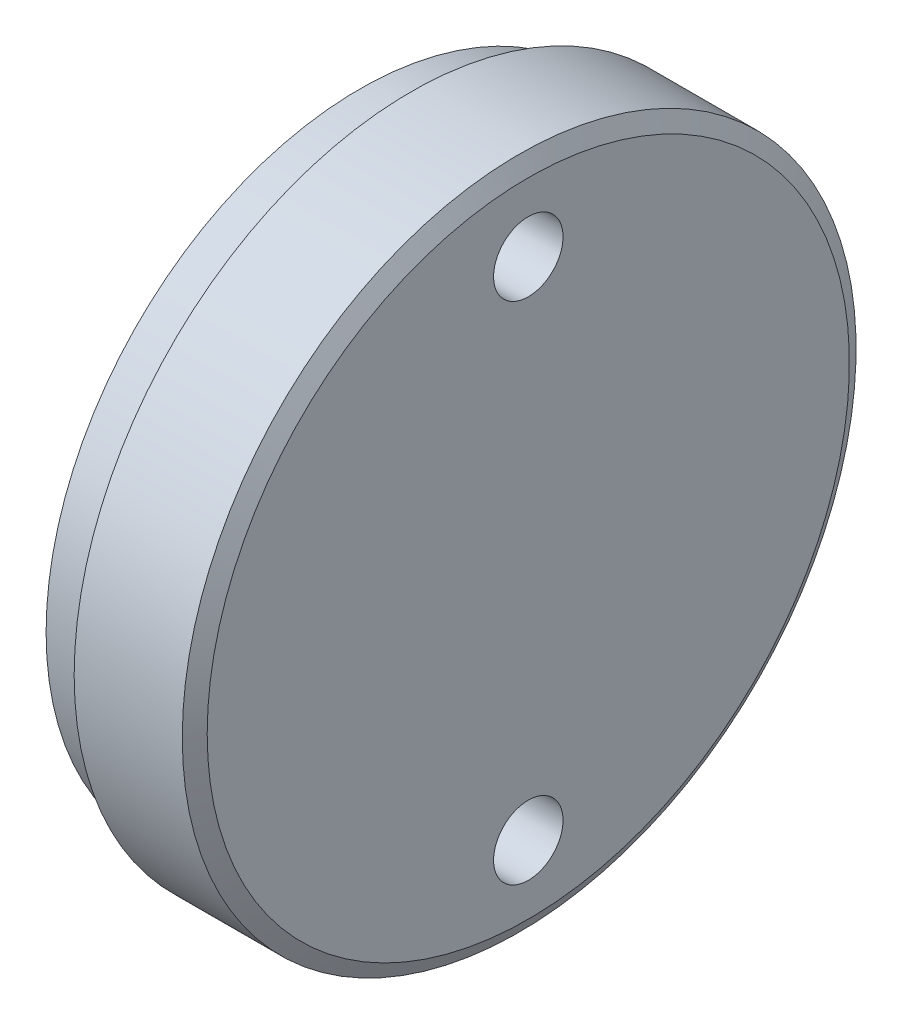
ISO-10303-21;
HEADER;
FILE_DESCRIPTION(('STEP AP214'),'2;1');
FILE_NAME('part.step','',(''),(''),'','','');
FILE_SCHEMA(('AUTOMOTIVE_DESIGN { 1 0 10303 214 1 1 1 1 }'));
ENDSEC;
DATA;
#1=APPLICATION_CONTEXT('core data for automotive mechanical design processes');
#2=APPLICATION_PROTOCOL_DEFINITION('international standard','automotive_design',2000,#1);
#3=PRODUCT_CONTEXT('',#1,'mechanical');
#4=PRODUCT('Part','Part','',(#3));
#5=PRODUCT_RELATED_PRODUCT_CATEGORY('part','',(#4));
#6=PRODUCT_DEFINITION_FORMATION('','',#4);
#7=PRODUCT_DEFINITION_CONTEXT('part definition',#1,'design');
#8=PRODUCT_DEFINITION('design','',#6,#7);
#9=PRODUCT_DEFINITION_SHAPE('','',#8);
#10=(LENGTH_UNIT() NAMED_UNIT(*) SI_UNIT(.MILLI.,.METRE.));
#11=(NAMED_UNIT(*) PLANE_ANGLE_UNIT() SI_UNIT($,.RADIAN.));
#12=(NAMED_UNIT(*) SI_UNIT($,.STERADIAN.) SOLID_ANGLE_UNIT());
#13=UNCERTAINTY_MEASURE_WITH_UNIT(LENGTH_MEASURE(1.E-05),#10,'distance_accuracy_value','');
#14=(GEOMETRIC_REPRESENTATION_CONTEXT(3) GLOBAL_UNCERTAINTY_ASSIGNED_CONTEXT((#13)) GLOBAL_UNIT_ASSIGNED_CONTEXT((#10,
#11,#12)) REPRESENTATION_CONTEXT('',''));
#15=CARTESIAN_POINT('',(0.,0.,0.));
#16=DIRECTION('',(0.,0.,1.));
#17=DIRECTION('',(1.,0.,0.));
#18=AXIS2_PLACEMENT_3D('',#15,#16,#17);
#19=CARTESIAN_POINT('',(46.5,32.954952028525,-32.));
#20=DIRECTION('',(-1.,0.,0.));
#21=DIRECTION('',(0.,0.,1.));
#22=AXIS2_PLACEMENT_3D('',#19,#20,#21);
#23=PLANE('',#22);
#24=CARTESIAN_POINT('',(46.5,25.07,-32.));
#25=DIRECTION('',(1.,0.,0.));
#26=DIRECTION('',(0.,0.,1.));
#27=AXIS2_PLACEMENT_3D('',#24,#25,#26);
#28=CIRCLE('',#27,6.48602905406);
#29=CARTESIAN_POINT('',(46.5,25.07,-25.51397094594));
#30=VERTEX_POINT('',#29);
#31=EDGE_CURVE('E63',#30,#30,#28,.F.);
#32=ORIENTED_EDGE('',*,*,#31,.T.);
#33=EDGE_LOOP('',(#32));
#34=FACE_BOUND('',#33,.T.);
#35=ADVANCED_FACE('F17',(#34),#23,.T.);
#36=CARTESIAN_POINT('',(43.5,25.07,-32.));
#37=DIRECTION('',(-1.,0.,0.));
#38=DIRECTION('',(0.,0.,1.));
#39=AXIS2_PLACEMENT_3D('',#36,#37,#38);
#40=TOROIDAL_SURFACE('',#39,6.48602905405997,3.);
#41=CARTESIAN_POINT('',(45.4283628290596,25.07,-32.));
#42=DIRECTION('',(-1.,0.,0.));
#43=DIRECTION('',(0.,0.,1.));
#44=AXIS2_PLACEMENT_3D('',#41,#42,#43);
#45=CIRCLE('',#44,8.7841623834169);
#46=CARTESIAN_POINT('',(45.4283628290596,25.07,-23.2158376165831));
#47=VERTEX_POINT('',#46);
#48=EDGE_CURVE('E89',#47,#47,#45,.T.);
#49=ORIENTED_EDGE('',*,*,#48,.T.);
#50=EDGE_LOOP('',(#49));
#51=FACE_BOUND('',#50,.T.);
#52=ORIENTED_EDGE('',*,*,#31,.F.);
#53=EDGE_LOOP('',(#52));
#54=FACE_BOUND('',#53,.T.);
#55=ADVANCED_FACE('F68',(#51,#54),#40,.F.);
#56=CARTESIAN_POINT('',(41.,25.07,-32.));
#57=DIRECTION('',(-1.,0.,0.));
#58=DIRECTION('',(0.,0.,1.));
#59=AXIS2_PLACEMENT_3D('',#56,#57,#58);
#60=CONICAL_SURFACE('',#59,12.5,0.698131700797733);
#61=CARTESIAN_POINT('',(41.,25.07,-32.));
#62=DIRECTION('',(-1.,0.,0.));
#63=DIRECTION('',(0.,0.,1.));
#64=AXIS2_PLACEMENT_3D('',#61,#62,#63);
#65=CIRCLE('',#64,12.5);
#66=CARTESIAN_POINT('',(41.,25.07,-19.5));
#67=VERTEX_POINT('',#66);
#68=EDGE_CURVE('E21',#67,#67,#65,.F.);
#69=ORIENTED_EDGE('',*,*,#68,.F.);
#70=EDGE_LOOP('',(#69));
#71=FACE_BOUND('',#70,.T.);
#72=ORIENTED_EDGE('',*,*,#48,.F.);
#73=EDGE_LOOP('',(#72));
#74=FACE_BOUND('',#73,.T.);
#75=ADVANCED_FACE('F79',(#71,#74),#60,.F.);
#76=CARTESIAN_POINT('',(41.,39.97,-32.));
#77=DIRECTION('',(-1.,0.,0.));
#78=DIRECTION('',(0.,0.,1.));
#79=AXIS2_PLACEMENT_3D('',#76,#77,#78);
#80=PLANE('',#79);
#81=CARTESIAN_POINT('',(41.,25.07,-32.));
#82=DIRECTION('',(-1.,0.,0.));
#83=DIRECTION('',(0.,0.,1.));
#84=AXIS2_PLACEMENT_3D('',#81,#82,#83);
#85=CIRCLE('',#84,14.9);
#86=CARTESIAN_POINT('',(41.,25.07,-17.1));
#87=VERTEX_POINT('',#86);
#88=EDGE_CURVE('E106',#87,#87,#85,.F.);
#89=ORIENTED_EDGE('',*,*,#88,.F.);
#90=EDGE_LOOP('',(#89));
#91=FACE_BOUND('',#90,.T.);
#92=ORIENTED_EDGE('',*,*,#68,.T.);
#93=EDGE_LOOP('',(#92));
#94=FACE_BOUND('',#93,.T.);
#95=ADVANCED_FACE('F115',(#91,#94),#80,.T.);
#96=CARTESIAN_POINT('',(49.,25.07,-32.));
#97=DIRECTION('',(-1.,0.,0.));
#98=DIRECTION('',(0.,0.,1.));
#99=AXIS2_PLACEMENT_3D('',#96,#97,#98);
#100=CYLINDRICAL_SURFACE('',#99,14.9);
#101=CARTESIAN_POINT('',(43.,25.07,-32.));
#102=DIRECTION('',(-1.,0.,0.));
#103=DIRECTION('',(0.,0.,1.));
#104=AXIS2_PLACEMENT_3D('',#101,#102,#103);
#105=CIRCLE('',#104,14.9);
#106=CARTESIAN_POINT('',(43.,25.07,-17.1));
#107=VERTEX_POINT('',#106);
#108=EDGE_CURVE('E101',#107,#107,#105,.F.);
#109=ORIENTED_EDGE('',*,*,#108,.F.);
#110=EDGE_LOOP('',(#109));
#111=FACE_BOUND('',#110,.T.);
#112=ORIENTED_EDGE('',*,*,#88,.T.);
#113=EDGE_LOOP('',(#112));
#114=FACE_BOUND('',#113,.T.);
#115=ADVANCED_FACE('F124',(#111,#114),#100,.T.);
#116=CARTESIAN_POINT('',(43.,41.07,-32.));
#117=DIRECTION('',(-1.,0.,0.));
#118=DIRECTION('',(0.,0.,1.));
#119=AXIS2_PLACEMENT_3D('',#116,#117,#118);
#120=PLANE('',#119);
#121=ORIENTED_EDGE('',*,*,#108,.T.);
#122=EDGE_LOOP('',(#121));
#123=FACE_BOUND('',#122,.T.);
#124=CARTESIAN_POINT('',(43.,25.07,-32.));
#125=DIRECTION('',(1.,0.,0.));
#126=DIRECTION('',(0.,0.,-1.));
#127=AXIS2_PLACEMENT_3D('',#124,#125,#126);
#128=CIRCLE('',#127,15.25);
#129=CARTESIAN_POINT('',(43.,25.07,-47.25));
#130=VERTEX_POINT('',#129);
#131=EDGE_CURVE('E96',#130,#130,#128,.T.);
#132=ORIENTED_EDGE('',*,*,#131,.F.);
#133=EDGE_LOOP('',(#132));
#134=FACE_BOUND('',#133,.T.);
#135=ADVANCED_FACE('F154',(#123,#134),#120,.T.);
#136=CARTESIAN_POINT('',(43.4330127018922,25.07,-32.));
#137=DIRECTION('',(1.,0.,0.));
#138=DIRECTION('',(0.,0.,-1.));
#139=AXIS2_PLACEMENT_3D('',#136,#137,#138);
#140=CONICAL_SURFACE('',#139,16.,1.0471975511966);
#141=CARTESIAN_POINT('',(43.4330127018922,25.07,-32.));
#142=DIRECTION('',(-1.,0.,0.));
#143=DIRECTION('',(0.,0.,1.));
#144=AXIS2_PLACEMENT_3D('',#141,#142,#143);
#145=CIRCLE('',#144,16.);
#146=CARTESIAN_POINT('',(43.4330127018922,25.07,-16.));
#147=VERTEX_POINT('',#146);
#148=EDGE_CURVE('E50',#147,#147,#145,.F.);
#149=ORIENTED_EDGE('',*,*,#148,.F.);
#150=EDGE_LOOP('',(#149));
#151=FACE_BOUND('',#150,.T.);
#152=ORIENTED_EDGE('',*,*,#131,.T.);
#153=EDGE_LOOP('',(#152));
#154=FACE_BOUND('',#153,.T.);
#155=ADVANCED_FACE('F149',(#151,#154),#140,.T.);
#156=CARTESIAN_POINT('',(49.,25.07,-32.));
#157=DIRECTION('',(-1.,0.,0.));
#158=DIRECTION('',(0.,0.,1.));
#159=AXIS2_PLACEMENT_3D('',#156,#157,#158);
#160=CYLINDRICAL_SURFACE('',#159,16.);
#161=ORIENTED_EDGE('',*,*,#148,.T.);
#162=EDGE_LOOP('',(#161));
#163=FACE_BOUND('',#162,.T.);
#164=CARTESIAN_POINT('',(48.5669872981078,25.07,-32.));
#165=DIRECTION('',(-1.,0.,0.));
#166=DIRECTION('',(0.,0.,1.));
#167=AXIS2_PLACEMENT_3D('',#164,#165,#166);
#168=CIRCLE('',#167,16.);
#169=CARTESIAN_POINT('',(48.5669872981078,25.07,-16.));
#170=VERTEX_POINT('',#169);
#171=EDGE_CURVE('E44',#170,#170,#168,.F.);
#172=ORIENTED_EDGE('',*,*,#171,.F.);
#173=EDGE_LOOP('',(#172));
#174=FACE_BOUND('',#173,.T.);
#175=ADVANCED_FACE('F37',(#163,#174),#160,.T.);
#176=CARTESIAN_POINT('',(45.0000000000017,13.07,-32.));
#177=DIRECTION('',(1.,0.,0.));
#178=DIRECTION('',(0.,1.,0.));
#179=AXIS2_PLACEMENT_3D('',#176,#177,#178);
#180=CONICAL_SURFACE('',#179,1.64999999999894,1.04719755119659);
#181=CARTESIAN_POINT('',(44.0473720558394,13.07,-32.));
#182=VERTEX_POINT('',#181);
#183=VERTEX_LOOP('',#182);
#184=FACE_BOUND('',#183,.T.);
#185=CARTESIAN_POINT('',(45.,13.07,-32.));
#186=DIRECTION('',(-1.,0.,0.));
#187=DIRECTION('',(0.,0.,1.));
#188=AXIS2_PLACEMENT_3D('',#185,#186,#187);
#189=CIRCLE('',#188,1.65);
#190=CARTESIAN_POINT('',(45.,13.07,-30.35));
#191=VERTEX_POINT('',#190);
#192=EDGE_CURVE('E41',#191,#191,#189,.F.);
#193=ORIENTED_EDGE('',*,*,#192,.T.);
#194=EDGE_LOOP('',(#193));
#195=FACE_BOUND('',#194,.T.);
#196=ADVANCED_FACE('F33',(#184,#195),#180,.F.);
#197=CARTESIAN_POINT('',(45.0000000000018,37.07,-32.));
#198=DIRECTION('',(1.,0.,0.));
#199=DIRECTION('',(0.,1.,0.));
#200=AXIS2_PLACEMENT_3D('',#197,#198,#199);
#201=CONICAL_SURFACE('',#200,1.649999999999,1.04719755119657);
#202=CARTESIAN_POINT('',(44.0473720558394,37.0699999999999,-32.));
#203=VERTEX_POINT('',#202);
#204=VERTEX_LOOP('',#203);
#205=FACE_BOUND('',#204,.T.);
#206=CARTESIAN_POINT('',(45.,37.07,-32.));
#207=DIRECTION('',(-1.,0.,0.));
#208=DIRECTION('',(0.,0.,1.));
#209=AXIS2_PLACEMENT_3D('',#206,#207,#208);
#210=CIRCLE('',#209,1.65);
#211=CARTESIAN_POINT('',(45.,37.07,-30.35));
#212=VERTEX_POINT('',#211);
#213=EDGE_CURVE('E43',#212,#212,#210,.F.);
#214=ORIENTED_EDGE('',*,*,#213,.T.);
#215=EDGE_LOOP('',(#214));
#216=FACE_BOUND('',#215,.T.);
#217=ADVANCED_FACE('F36',(#205,#216),#201,.F.);
#218=CARTESIAN_POINT('',(48.5669872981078,25.07,-32.));
#219=DIRECTION('',(-1.,0.,0.));
#220=DIRECTION('',(0.,0.,1.));
#221=AXIS2_PLACEMENT_3D('',#218,#219,#220);
#222=CONICAL_SURFACE('',#221,16.,1.0471975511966);
#223=CARTESIAN_POINT('',(49.,25.07,-32.));
#224=DIRECTION('',(-1.,0.,0.));
#225=DIRECTION('',(0.,0.,1.));
#226=AXIS2_PLACEMENT_3D('',#223,#224,#225);
#227=CIRCLE('',#226,15.25);
#228=CARTESIAN_POINT('',(49.,25.07,-16.75));
#229=VERTEX_POINT('',#228);
#230=EDGE_CURVE('E47',#229,#229,#227,.F.);
#231=ORIENTED_EDGE('',*,*,#230,.F.);
#232=EDGE_LOOP('',(#231));
#233=FACE_BOUND('',#232,.T.);
#234=ORIENTED_EDGE('',*,*,#171,.T.);
#235=EDGE_LOOP('',(#234));
#236=FACE_BOUND('',#235,.T.);
#237=ADVANCED_FACE('F142',(#233,#236),#222,.T.);
#238=CARTESIAN_POINT('',(45.,13.07,-32.));
#239=DIRECTION('',(-1.,0.,0.));
#240=DIRECTION('',(0.,0.,1.));
#241=AXIS2_PLACEMENT_3D('',#238,#239,#240);
#242=CYLINDRICAL_SURFACE('',#241,1.65);
#243=ORIENTED_EDGE('',*,*,#192,.F.);
#244=EDGE_LOOP('',(#243));
#245=FACE_BOUND('',#244,.T.);
#246=CARTESIAN_POINT('',(49.,13.07,-32.));
#247=DIRECTION('',(-1.,0.,0.));
#248=DIRECTION('',(0.,0.,1.));
#249=AXIS2_PLACEMENT_3D('',#246,#247,#248);
#250=CIRCLE('',#249,1.65);
#251=CARTESIAN_POINT('',(49.,13.07,-30.35));
#252=VERTEX_POINT('',#251);
#253=EDGE_CURVE('E26',#252,#252,#250,.T.);
#254=ORIENTED_EDGE('',*,*,#253,.F.);
#255=EDGE_LOOP('',(#254));
#256=FACE_BOUND('',#255,.T.);
#257=ADVANCED_FACE('F132',(#245,#256),#242,.F.);
#258=CARTESIAN_POINT('',(45.,37.07,-32.));
#259=DIRECTION('',(-1.,0.,0.));
#260=DIRECTION('',(0.,0.,1.));
#261=AXIS2_PLACEMENT_3D('',#258,#259,#260);
#262=CYLINDRICAL_SURFACE('',#261,1.65);
#263=ORIENTED_EDGE('',*,*,#213,.F.);
#264=EDGE_LOOP('',(#263));
#265=FACE_BOUND('',#264,.T.);
#266=CARTESIAN_POINT('',(49.,37.07,-32.));
#267=DIRECTION('',(-1.,0.,0.));
#268=DIRECTION('',(0.,0.,1.));
#269=AXIS2_PLACEMENT_3D('',#266,#267,#268);
#270=CIRCLE('',#269,1.65);
#271=CARTESIAN_POINT('',(49.,37.07,-30.35));
#272=VERTEX_POINT('',#271);
#273=EDGE_CURVE('E11',#272,#272,#270,.T.);
#274=ORIENTED_EDGE('',*,*,#273,.F.);
#275=EDGE_LOOP('',(#274));
#276=FACE_BOUND('',#275,.T.);
#277=ADVANCED_FACE('F127',(#265,#276),#262,.F.);
#278=CARTESIAN_POINT('',(49.,25.07,-32.));
#279=DIRECTION('',(1.,0.,0.));
#280=DIRECTION('',(0.,0.,-1.));
#281=AXIS2_PLACEMENT_3D('',#278,#279,#280);
#282=PLANE('',#281);
#283=ORIENTED_EDGE('',*,*,#273,.T.);
#284=EDGE_LOOP('',(#283));
#285=FACE_BOUND('',#284,.T.);
#286=ORIENTED_EDGE('',*,*,#253,.T.);
#287=EDGE_LOOP('',(#286));
#288=FACE_BOUND('',#287,.T.);
#289=ORIENTED_EDGE('',*,*,#230,.T.);
#290=EDGE_LOOP('',(#289));
#291=FACE_BOUND('',#290,.T.);
#292=ADVANCED_FACE('F19',(#285,#288,#291),#282,.T.);
#293=CLOSED_SHELL('',(#35,#55,#75,#95,#115,#135,#155,#175,#196,#217,#237,#257,#277,#292));
#294=MANIFOLD_SOLID_BREP('B1',#293);
#295=ADVANCED_BREP_SHAPE_REPRESENTATION('',(#18,#294),#14);
#296=SHAPE_DEFINITION_REPRESENTATION(#9,#295);
ENDSEC;
END-ISO-10303-21;
